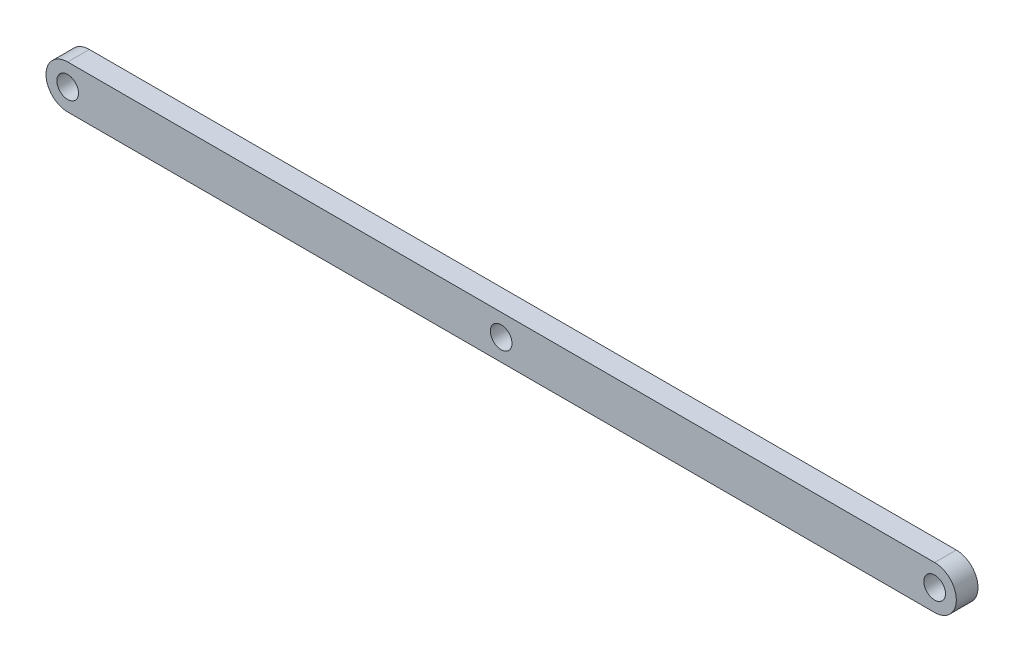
from build123d import *

# Parameters (mm, degrees)
SKETCH1_R           = 1.5875
BOSS_EXTRUDE1_DEPTH = 3.175


with BuildPart() as part:
    # Sketch1 → Boss-Extrude1 (new body)
    with BuildSketch(Plane.XY):
        with BuildLine():
            Line((0, 3.175), (127, 3.175))
            ThreePointArc((127, 3.175), (130.175, 0), (127, -3.175))
            Line((127, -3.175), (0, -3.175))
            ThreePointArc((0, -3.175), (-3.175, 0), (0, 3.175))
        make_face()
        Circle(SKETCH1_R, mode=Mode.SUBTRACT)
        with Locations((127, 0)):
            Circle(SKETCH1_R, mode=Mode.SUBTRACT)
        with Locations((63.5, 0)):
            Circle(SKETCH1_R, mode=Mode.SUBTRACT)
    extrude(amount=BOSS_EXTRUDE1_DEPTH)


solid = part.part
